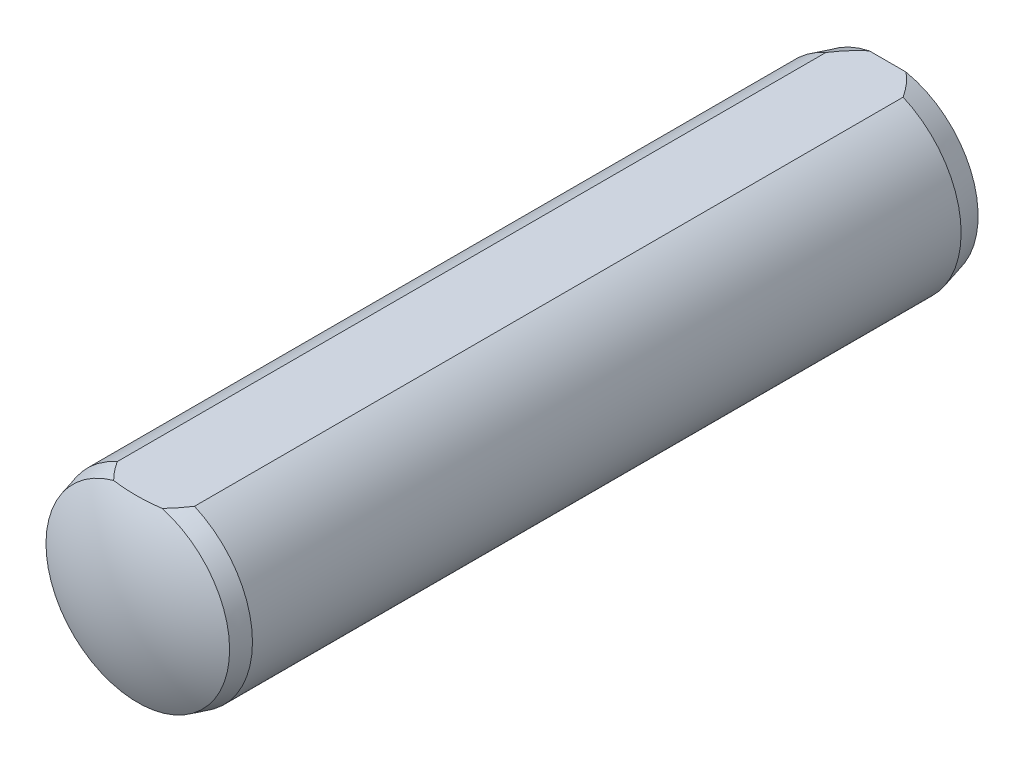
ISO-10303-21;
HEADER;
FILE_DESCRIPTION(('STEP AP214'),'2;1');
FILE_NAME('part.step','',(''),(''),'','','');
FILE_SCHEMA(('AUTOMOTIVE_DESIGN { 1 0 10303 214 1 1 1 1 }'));
ENDSEC;
DATA;
#1=APPLICATION_CONTEXT('core data for automotive mechanical design processes');
#2=APPLICATION_PROTOCOL_DEFINITION('international standard','automotive_design',2000,#1);
#3=PRODUCT_CONTEXT('',#1,'mechanical');
#4=PRODUCT('Part','Part','',(#3));
#5=PRODUCT_RELATED_PRODUCT_CATEGORY('part','',(#4));
#6=PRODUCT_DEFINITION_FORMATION('','',#4);
#7=PRODUCT_DEFINITION_CONTEXT('part definition',#1,'design');
#8=PRODUCT_DEFINITION('design','',#6,#7);
#9=PRODUCT_DEFINITION_SHAPE('','',#8);
#10=(LENGTH_UNIT() NAMED_UNIT(*) SI_UNIT(.MILLI.,.METRE.));
#11=(NAMED_UNIT(*) PLANE_ANGLE_UNIT() SI_UNIT($,.RADIAN.));
#12=(NAMED_UNIT(*) SI_UNIT($,.STERADIAN.) SOLID_ANGLE_UNIT());
#13=UNCERTAINTY_MEASURE_WITH_UNIT(LENGTH_MEASURE(1.E-05),#10,'distance_accuracy_value','');
#14=(GEOMETRIC_REPRESENTATION_CONTEXT(3) GLOBAL_UNCERTAINTY_ASSIGNED_CONTEXT((#13)) GLOBAL_UNIT_ASSIGNED_CONTEXT((#10,
#11,#12)) REPRESENTATION_CONTEXT('',''));
#15=CARTESIAN_POINT('',(0.,0.,0.));
#16=DIRECTION('',(0.,0.,1.));
#17=DIRECTION('',(1.,0.,0.));
#18=AXIS2_PLACEMENT_3D('',#15,#16,#17);
#19=CARTESIAN_POINT('',(0.,0.,15.));
#20=DIRECTION('',(0.,0.,1.));
#21=DIRECTION('',(0.,1.,0.));
#22=AXIS2_PLACEMENT_3D('',#19,#20,#21);
#23=SPHERICAL_SURFACE('',#22,5.);
#24=CARTESIAN_POINT('',(0.,0.,19.4));
#25=DIRECTION('',(0.,0.,1.));
#26=DIRECTION('',(1.,0.,0.));
#27=AXIS2_PLACEMENT_3D('',#24,#25,#26);
#28=CIRCLE('',#27,2.37486841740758);
#29=CARTESIAN_POINT('',(-0.624499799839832,2.29128784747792,19.4));
#30=VERTEX_POINT('',#29);
#31=CARTESIAN_POINT('',(0.624499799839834,2.29128784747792,19.4));
#32=VERTEX_POINT('',#31);
#33=EDGE_CURVE('E126',#30,#32,#28,.T.);
#34=ORIENTED_EDGE('',*,*,#33,.T.);
#35=CARTESIAN_POINT('',(0.,2.29128784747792,15.));
#36=DIRECTION('',(0.,-1.,0.));
#37=DIRECTION('',(0.,0.,-1.));
#38=AXIS2_PLACEMENT_3D('',#35,#36,#37);
#39=CIRCLE('',#38,4.4440972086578);
#40=EDGE_CURVE('E87',#32,#30,#39,.T.);
#41=ORIENTED_EDGE('',*,*,#40,.T.);
#42=EDGE_LOOP('',(#34,#41));
#43=FACE_BOUND('',#42,.T.);
#44=ADVANCED_FACE('F32',(#43),#23,.T.);
#45=CARTESIAN_POINT('',(0.,0.,6.4));
#46=DIRECTION('',(0.,0.,-1.));
#47=DIRECTION('',(-1.,0.,0.));
#48=AXIS2_PLACEMENT_3D('',#45,#46,#47);
#49=CONICAL_SURFACE('',#48,0.,1.04719755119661);
#50=CARTESIAN_POINT('',(0.,0.,5.67831216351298));
#51=DIRECTION('',(0.,0.,1.));
#52=DIRECTION('',(1.,0.,0.));
#53=AXIS2_PLACEMENT_3D('',#50,#51,#52);
#54=CIRCLE('',#53,1.25);
#55=CARTESIAN_POINT('',(1.25,0.,5.67831216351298));
#56=VERTEX_POINT('',#55);
#57=EDGE_CURVE('E116',#56,#56,#54,.T.);
#58=ORIENTED_EDGE('',*,*,#57,.F.);
#59=EDGE_LOOP('',(#58));
#60=FACE_BOUND('',#59,.T.);
#61=CARTESIAN_POINT('',(0.,0.,6.4));
#62=VERTEX_POINT('',#61);
#63=VERTEX_LOOP('',#62);
#64=FACE_BOUND('',#63,.T.);
#65=ADVANCED_FACE('F150',(#60,#64),#49,.F.);
#66=CARTESIAN_POINT('',(0.,0.,6.4));
#67=DIRECTION('',(0.,0.,1.));
#68=DIRECTION('',(1.,0.,0.));
#69=AXIS2_PLACEMENT_3D('',#66,#67,#68);
#70=CYLINDRICAL_SURFACE('',#69,1.25);
#71=CARTESIAN_POINT('',(0.,0.,6.));
#72=DIRECTION('',(0.,0.,1.));
#73=DIRECTION('',(1.,0.,0.));
#74=AXIS2_PLACEMENT_3D('',#71,#72,#73);
#75=CIRCLE('',#74,1.25);
#76=CARTESIAN_POINT('',(1.25,0.,6.));
#77=VERTEX_POINT('',#76);
#78=EDGE_CURVE('E114',#77,#77,#75,.T.);
#79=ORIENTED_EDGE('',*,*,#78,.F.);
#80=EDGE_LOOP('',(#79));
#81=FACE_BOUND('',#80,.T.);
#82=ORIENTED_EDGE('',*,*,#57,.T.);
#83=EDGE_LOOP('',(#82));
#84=FACE_BOUND('',#83,.T.);
#85=ADVANCED_FACE('F155',(#81,#84),#70,.T.);
#86=CARTESIAN_POINT('',(0.,1.5,6.));
#87=DIRECTION('',(0.,0.,1.));
#88=DIRECTION('',(1.,0.,0.));
#89=AXIS2_PLACEMENT_3D('',#86,#87,#88);
#90=PLANE('',#89);
#91=CARTESIAN_POINT('',(0.,0.,6.));
#92=DIRECTION('',(0.,0.,1.));
#93=DIRECTION('',(1.,0.,0.));
#94=AXIS2_PLACEMENT_3D('',#91,#92,#93);
#95=CIRCLE('',#94,1.5);
#96=CARTESIAN_POINT('',(1.5,0.,6.));
#97=VERTEX_POINT('',#96);
#98=EDGE_CURVE('E111',#97,#97,#95,.T.);
#99=ORIENTED_EDGE('',*,*,#98,.F.);
#100=EDGE_LOOP('',(#99));
#101=FACE_BOUND('',#100,.T.);
#102=ORIENTED_EDGE('',*,*,#78,.T.);
#103=EDGE_LOOP('',(#102));
#104=FACE_BOUND('',#103,.T.);
#105=ADVANCED_FACE('F161',(#101,#104),#90,.F.);
#106=CARTESIAN_POINT('',(0.,0.,6.4));
#107=DIRECTION('',(0.,0.,1.));
#108=DIRECTION('',(1.,0.,0.));
#109=AXIS2_PLACEMENT_3D('',#106,#107,#108);
#110=CYLINDRICAL_SURFACE('',#109,1.5);
#111=CARTESIAN_POINT('',(0.,0.,1.08660254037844));
#112=DIRECTION('',(0.,0.,1.));
#113=DIRECTION('',(1.,0.,0.));
#114=AXIS2_PLACEMENT_3D('',#111,#112,#113);
#115=CIRCLE('',#114,1.5);
#116=CARTESIAN_POINT('',(1.5,0.,1.08660254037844));
#117=VERTEX_POINT('',#116);
#118=EDGE_CURVE('E108',#117,#117,#115,.T.);
#119=ORIENTED_EDGE('',*,*,#118,.F.);
#120=EDGE_LOOP('',(#119));
#121=FACE_BOUND('',#120,.T.);
#122=ORIENTED_EDGE('',*,*,#98,.T.);
#123=EDGE_LOOP('',(#122));
#124=FACE_BOUND('',#123,.T.);
#125=ADVANCED_FACE('F167',(#121,#124),#110,.F.);
#126=CARTESIAN_POINT('',(0.,0.,1.08660254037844));
#127=DIRECTION('',(0.,0.,-1.));
#128=DIRECTION('',(-1.,0.,0.));
#129=AXIS2_PLACEMENT_3D('',#126,#127,#128);
#130=CONICAL_SURFACE('',#129,1.5,1.04719755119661);
#131=CARTESIAN_POINT('',(0.,0.,1.));
#132=DIRECTION('',(0.,0.,1.));
#133=DIRECTION('',(1.,0.,0.));
#134=AXIS2_PLACEMENT_3D('',#131,#132,#133);
#135=CIRCLE('',#134,1.65);
#136=CARTESIAN_POINT('',(1.65,0.,1.));
#137=VERTEX_POINT('',#136);
#138=EDGE_CURVE('E100',#137,#137,#135,.T.);
#139=ORIENTED_EDGE('',*,*,#138,.F.);
#140=EDGE_LOOP('',(#139));
#141=FACE_BOUND('',#140,.T.);
#142=ORIENTED_EDGE('',*,*,#118,.T.);
#143=EDGE_LOOP('',(#142));
#144=FACE_BOUND('',#143,.T.);
#145=ADVANCED_FACE('F171',(#141,#144),#130,.F.);
#146=CARTESIAN_POINT('',(0.,0.,6.4));
#147=DIRECTION('',(0.,0.,1.));
#148=DIRECTION('',(1.,0.,0.));
#149=AXIS2_PLACEMENT_3D('',#146,#147,#148);
#150=CYLINDRICAL_SURFACE('',#149,1.65);
#151=CARTESIAN_POINT('',(0.,0.,0.));
#152=DIRECTION('',(0.,0.,1.));
#153=DIRECTION('',(1.,0.,0.));
#154=AXIS2_PLACEMENT_3D('',#151,#152,#153);
#155=CIRCLE('',#154,1.65);
#156=CARTESIAN_POINT('',(1.65,0.,0.));
#157=VERTEX_POINT('',#156);
#158=EDGE_CURVE('E96',#157,#157,#155,.T.);
#159=ORIENTED_EDGE('',*,*,#158,.F.);
#160=EDGE_LOOP('',(#159));
#161=FACE_BOUND('',#160,.T.);
#162=ORIENTED_EDGE('',*,*,#138,.T.);
#163=EDGE_LOOP('',(#162));
#164=FACE_BOUND('',#163,.T.);
#165=ADVANCED_FACE('F175',(#161,#164),#150,.F.);
#166=CARTESIAN_POINT('',(0.,2.33923048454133,0.));
#167=DIRECTION('',(0.,0.,1.));
#168=DIRECTION('',(1.,0.,0.));
#169=AXIS2_PLACEMENT_3D('',#166,#167,#168);
#170=PLANE('',#169);
#171=CARTESIAN_POINT('',(0.,0.,0.));
#172=DIRECTION('',(0.,0.,1.));
#173=DIRECTION('',(1.,0.,0.));
#174=AXIS2_PLACEMENT_3D('',#171,#172,#173);
#175=CIRCLE('',#174,2.33923048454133);
#176=CARTESIAN_POINT('',(-0.471167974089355,2.29128784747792,0.));
#177=VERTEX_POINT('',#176);
#178=CARTESIAN_POINT('',(0.471167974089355,2.29128784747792,0.));
#179=VERTEX_POINT('',#178);
#180=EDGE_CURVE('E93',#177,#179,#175,.T.);
#181=ORIENTED_EDGE('',*,*,#180,.F.);
#182=DIRECTION('',(-1.,0.,0.));
#183=VECTOR('',#182,1.);
#184=CARTESIAN_POINT('',(1.,2.29128784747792,0.));
#185=LINE('',#184,#183);
#186=EDGE_CURVE('E78',#179,#177,#185,.T.);
#187=ORIENTED_EDGE('',*,*,#186,.F.);
#188=EDGE_LOOP('',(#181,#187));
#189=FACE_BOUND('',#188,.T.);
#190=ORIENTED_EDGE('',*,*,#158,.T.);
#191=EDGE_LOOP('',(#190));
#192=FACE_BOUND('',#191,.T.);
#193=ADVANCED_FACE('F91',(#189,#192),#170,.F.);
#194=CARTESIAN_POINT('',(0.,0.,0.));
#195=DIRECTION('',(0.,0.,1.));
#196=DIRECTION('',(1.,0.,0.));
#197=AXIS2_PLACEMENT_3D('',#194,#195,#196);
#198=CONICAL_SURFACE('',#197,2.33923048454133,0.261799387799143);
#199=CARTESIAN_POINT('',(0.,0.,0.6));
#200=DIRECTION('',(0.,0.,1.));
#201=DIRECTION('',(1.,0.,0.));
#202=AXIS2_PLACEMENT_3D('',#199,#200,#201);
#203=CIRCLE('',#202,2.5);
#204=CARTESIAN_POINT('',(-1.,2.29128784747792,0.6));
#205=VERTEX_POINT('',#204);
#206=CARTESIAN_POINT('',(1.,2.29128784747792,0.6));
#207=VERTEX_POINT('',#206);
#208=EDGE_CURVE('E97',#205,#207,#203,.T.);
#209=ORIENTED_EDGE('',*,*,#208,.F.);
#210=CARTESIAN_POINT('',(-1.67077202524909,2.29128784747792,1.85303678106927));
#211=CARTESIAN_POINT('',(-1.62356949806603,2.29128784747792,1.74936709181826));
#212=CARTESIAN_POINT('',(-1.57536560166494,2.29128784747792,1.64613079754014));
#213=CARTESIAN_POINT('',(-1.47612152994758,2.29128784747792,1.44077448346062));
#214=CARTESIAN_POINT('',(-1.42507575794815,2.29128784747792,1.33865717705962));
#215=CARTESIAN_POINT('',(-1.31778480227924,2.29128784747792,1.13292437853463));
#216=CARTESIAN_POINT('',(-1.26142451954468,2.29128784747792,1.02936815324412));
#217=CARTESIAN_POINT('',(-1.14372956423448,2.29128784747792,0.82523392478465));
#218=CARTESIAN_POINT('',(-1.08239962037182,2.29128784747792,0.72465321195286));
#219=CARTESIAN_POINT('',(-0.953096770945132,2.29128784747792,0.528730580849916));
#220=CARTESIAN_POINT('',(-0.88517531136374,2.29128784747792,0.433355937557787));
#221=CARTESIAN_POINT('',(-0.775669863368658,2.29128784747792,0.296895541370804));
#222=CARTESIAN_POINT('',(-0.738043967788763,2.29128784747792,0.252654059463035));
#223=CARTESIAN_POINT('',(-0.659543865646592,2.29128784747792,0.167180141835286));
#224=CARTESIAN_POINT('',(-0.618673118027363,2.29128784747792,0.125944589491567));
#225=CARTESIAN_POINT('',(-0.540762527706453,2.29128784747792,0.0550878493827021));
#226=CARTESIAN_POINT('',(-0.504404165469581,2.29128784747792,0.0247265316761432));
#227=CARTESIAN_POINT('',(-0.428435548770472,2.29128784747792,-0.0318304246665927));
#228=CARTESIAN_POINT('',(-0.388820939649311,2.29128784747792,-0.0580203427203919));
#229=CARTESIAN_POINT('',(-0.305439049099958,2.29128784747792,-0.104672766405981));
#230=CARTESIAN_POINT('',(-0.261617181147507,2.29128784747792,-0.125040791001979));
#231=CARTESIAN_POINT('',(-0.170863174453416,2.29128784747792,-0.156814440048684));
#232=CARTESIAN_POINT('',(-0.123944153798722,2.29128784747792,-0.168255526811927));
#233=CARTESIAN_POINT('',(-0.0409742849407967,2.29128784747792,-0.178580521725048));
#234=CARTESIAN_POINT('',(-0.00522769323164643,2.29128784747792,-0.179935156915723));
#235=CARTESIAN_POINT('',(0.0659711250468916,2.29128784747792,-0.176411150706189));
#236=CARTESIAN_POINT('',(0.101423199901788,2.29128784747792,-0.17152947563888));
#237=CARTESIAN_POINT('',(0.170829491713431,2.29128784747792,-0.156163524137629));
#238=CARTESIAN_POINT('',(0.20479139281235,2.29128784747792,-0.145712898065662));
#239=CARTESIAN_POINT('',(0.270918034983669,2.29128784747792,-0.120233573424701));
#240=CARTESIAN_POINT('',(0.303082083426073,2.29128784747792,-0.105203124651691));
#241=CARTESIAN_POINT('',(0.392489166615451,2.29128784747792,-0.0570483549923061));
#242=CARTESIAN_POINT('',(0.447339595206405,2.29128784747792,-0.0195241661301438));
#243=CARTESIAN_POINT('',(0.551185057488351,2.29128784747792,0.0629669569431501));
#244=CARTESIAN_POINT('',(0.600151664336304,2.29128784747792,0.10796770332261));
#245=CARTESIAN_POINT('',(0.717749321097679,2.29128784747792,0.227164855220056));
#246=CARTESIAN_POINT('',(0.783312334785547,2.29128784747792,0.304344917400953));
#247=CARTESIAN_POINT('',(0.907188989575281,2.29128784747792,0.46439487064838));
#248=CARTESIAN_POINT('',(0.965483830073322,2.29128784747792,0.547278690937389));
#249=CARTESIAN_POINT('',(1.07710907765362,2.29128784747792,0.716871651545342));
#250=CARTESIAN_POINT('',(1.13041407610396,2.29128784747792,0.803597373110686));
#251=CARTESIAN_POINT('',(1.23313212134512,2.29128784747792,0.97933166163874));
#252=CARTESIAN_POINT('',(1.28254386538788,2.29128784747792,1.06834097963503));
#253=CARTESIAN_POINT('',(1.39157850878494,2.29128784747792,1.27266836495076));
#254=CARTESIAN_POINT('',(1.45026745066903,2.29128784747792,1.38848298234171));
#255=CARTESIAN_POINT('',(1.53523801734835,2.29128784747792,1.56276631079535));
#256=CARTESIAN_POINT('',(1.56288279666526,2.29128784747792,1.6205805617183));
#257=CARTESIAN_POINT('',(1.61738792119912,2.29128784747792,1.73655746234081));
#258=CARTESIAN_POINT('',(1.64424849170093,2.29128784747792,1.79472000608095));
#259=CARTESIAN_POINT('',(1.67077202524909,2.29128784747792,1.85303678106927));
#260=B_SPLINE_CURVE_WITH_KNOTS('',3,(#210,#211,#212,#213,#214,#215,#216,#217,#218,#219,#220,
#221,#222,#223,#224,#225,#226,#227,#228,#229,#230,#231,#232,#233,#234,#235,#236,#237,#238,#239,
#240,#241,#242,#243,#244,#245,#246,#247,#248,#249,#250,#251,#252,#253,#254,#255,#256,#257,#258,
#259),.UNSPECIFIED.,.F.,.F.,(4,2,2,2,2,2,2,2,2,2,2,2,2,2,2,2,2,2,2,2,2,2,2,2,4),(0.,
0.341754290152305,0.684207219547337,1.03779629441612,1.3910527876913,1.74174531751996,
1.91586342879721,2.08979836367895,2.23168823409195,2.37377104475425,2.51804340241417,
2.66173967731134,2.76852312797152,2.87535854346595,2.98155560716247,3.08779330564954,
3.28599602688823,3.48512080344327,3.78812701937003,4.09190144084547,4.39714696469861,
4.70249419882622,5.09190654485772,5.28415416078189,5.4763459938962),.UNSPECIFIED.);
#261=EDGE_CURVE('E86',#205,#177,#260,.T.);
#262=ORIENTED_EDGE('',*,*,#261,.T.);
#263=ORIENTED_EDGE('',*,*,#180,.T.);
#264=EDGE_CURVE('E75',#179,#207,#260,.T.);
#265=ORIENTED_EDGE('',*,*,#264,.T.);
#266=EDGE_LOOP('',(#209,#262,#263,#265));
#267=FACE_BOUND('',#266,.T.);
#268=ADVANCED_FACE('F95',(#267),#198,.T.);
#269=CARTESIAN_POINT('',(0.,0.,6.4));
#270=DIRECTION('',(0.,0.,1.));
#271=DIRECTION('',(1.,0.,0.));
#272=AXIS2_PLACEMENT_3D('',#269,#270,#271);
#273=CYLINDRICAL_SURFACE('',#272,2.5);
#274=ORIENTED_EDGE('',*,*,#208,.T.);
#275=DIRECTION('',(0.,0.,-1.));
#276=VECTOR('',#275,1.);
#277=CARTESIAN_POINT('',(1.,2.29128784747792,20.));
#278=LINE('',#277,#276);
#279=CARTESIAN_POINT('',(1.,2.29128784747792,18.9330025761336));
#280=VERTEX_POINT('',#279);
#281=EDGE_CURVE('E81',#280,#207,#278,.T.);
#282=ORIENTED_EDGE('',*,*,#281,.F.);
#283=CARTESIAN_POINT('',(0.,0.,18.9330025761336));
#284=DIRECTION('',(0.,0.,1.));
#285=DIRECTION('',(1.,0.,0.));
#286=AXIS2_PLACEMENT_3D('',#283,#284,#285);
#287=CIRCLE('',#286,2.5);
#288=CARTESIAN_POINT('',(-0.999999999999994,2.29128784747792,18.9330025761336));
#289=VERTEX_POINT('',#288);
#290=EDGE_CURVE('E102',#289,#280,#287,.T.);
#291=ORIENTED_EDGE('',*,*,#290,.F.);
#292=DIRECTION('',(0.,0.,-1.));
#293=VECTOR('',#292,1.);
#294=CARTESIAN_POINT('',(-1.,2.29128784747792,20.));
#295=LINE('',#294,#293);
#296=EDGE_CURVE('E51',#289,#205,#295,.T.);
#297=ORIENTED_EDGE('',*,*,#296,.T.);
#298=EDGE_LOOP('',(#274,#282,#291,#297));
#299=FACE_BOUND('',#298,.T.);
#300=ADVANCED_FACE('F129',(#299),#273,.T.);
#301=CARTESIAN_POINT('',(0.,0.,18.9330025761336));
#302=DIRECTION('',(0.,0.,-1.));
#303=DIRECTION('',(-1.,0.,0.));
#304=AXIS2_PLACEMENT_3D('',#301,#302,#303);
#305=CONICAL_SURFACE('',#304,2.5,0.26179938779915);
#306=ORIENTED_EDGE('',*,*,#290,.T.);
#307=CARTESIAN_POINT('',(1.66140547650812,2.29128784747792,17.7005237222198));
#308=CARTESIAN_POINT('',(1.61455555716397,2.29128784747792,17.8030373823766));
#309=CARTESIAN_POINT('',(1.56671109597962,2.29128784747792,17.9051238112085));
#310=CARTESIAN_POINT('',(1.46821930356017,2.29128784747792,18.1081591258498));
#311=CARTESIAN_POINT('',(1.41756706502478,2.29128784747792,18.2091056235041));
#312=CARTESIAN_POINT('',(1.31317944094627,2.29128784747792,18.4084984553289));
#313=CARTESIAN_POINT('',(1.25946832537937,2.29128784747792,18.5069574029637));
#314=CARTESIAN_POINT('',(1.14754312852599,2.29128784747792,18.701223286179));
#315=CARTESIAN_POINT('',(1.08933263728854,2.29128784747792,18.7970322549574));
#316=CARTESIAN_POINT('',(0.986612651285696,2.29128784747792,18.9539310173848));
#317=CARTESIAN_POINT('',(0.943832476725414,2.29128784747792,19.0161462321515));
#318=CARTESIAN_POINT('',(0.854270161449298,2.29128784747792,19.1382715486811));
#319=CARTESIAN_POINT('',(0.807464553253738,2.29128784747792,19.198164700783));
#320=CARTESIAN_POINT('',(0.726816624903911,2.29128784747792,19.292702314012));
#321=CARTESIAN_POINT('',(0.694463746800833,2.29128784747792,19.3285960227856));
#322=CARTESIAN_POINT('',(0.6273359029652,2.29128784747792,19.3980286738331));
#323=CARTESIAN_POINT('',(0.592558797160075,2.29128784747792,19.431565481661));
#324=CARTESIAN_POINT('',(0.484362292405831,2.29128784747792,19.5268679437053));
#325=CARTESIAN_POINT('',(0.406407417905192,2.29128784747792,19.5841729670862));
#326=CARTESIAN_POINT('',(0.287435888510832,2.29128784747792,19.6458058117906));
#327=CARTESIAN_POINT('',(0.252275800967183,2.29128784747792,19.6613024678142));
#328=CARTESIAN_POINT('',(0.179958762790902,2.29128784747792,19.6866439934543));
#329=CARTESIAN_POINT('',(0.142804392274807,2.29128784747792,19.6964959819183));
#330=CARTESIAN_POINT('',(0.0669679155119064,2.29128784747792,19.7094486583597));
#331=CARTESIAN_POINT('',(0.0282754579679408,2.29128784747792,19.7124908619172));
#332=CARTESIAN_POINT('',(-0.0489988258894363,2.29128784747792,19.7111881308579));
#333=CARTESIAN_POINT('',(-0.0875805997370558,2.29128784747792,19.7068401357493));
#334=CARTESIAN_POINT('',(-0.159750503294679,2.29128784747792,19.6921269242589));
#335=CARTESIAN_POINT('',(-0.193467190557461,2.29128784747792,19.6823655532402));
#336=CARTESIAN_POINT('',(-0.259183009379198,2.29128784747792,19.6582587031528));
#337=CARTESIAN_POINT('',(-0.291181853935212,2.29128784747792,19.6439124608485));
#338=CARTESIAN_POINT('',(-0.379130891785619,2.29128784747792,19.598214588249));
#339=CARTESIAN_POINT('',(-0.432867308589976,2.29128784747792,19.562643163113));
#340=CARTESIAN_POINT('',(-0.534719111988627,2.29128784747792,19.4841372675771));
#341=CARTESIAN_POINT('',(-0.58280768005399,2.29128784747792,19.4411698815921));
#342=CARTESIAN_POINT('',(-0.696788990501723,2.29128784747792,19.3286478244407));
#343=CARTESIAN_POINT('',(-0.759929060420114,2.29128784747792,19.2563452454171));
#344=CARTESIAN_POINT('',(-0.879344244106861,2.29128784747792,19.1062035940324));
#345=CARTESIAN_POINT('',(-0.935601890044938,2.29128784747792,19.0283511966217));
#346=CARTESIAN_POINT('',(-1.04339728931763,2.29128784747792,18.8688659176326));
#347=CARTESIAN_POINT('',(-1.09490813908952,2.29128784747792,18.7872150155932));
#348=CARTESIAN_POINT('',(-1.19417483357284,2.29128784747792,18.6216523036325));
#349=CARTESIAN_POINT('',(-1.24192933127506,2.29128784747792,18.5377396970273));
#350=CARTESIAN_POINT('',(-1.35592554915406,2.29128784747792,18.3292555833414));
#351=CARTESIAN_POINT('',(-1.42052889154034,2.29128784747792,18.2037909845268));
#352=CARTESIAN_POINT('',(-1.51365705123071,2.29128784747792,18.0149267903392));
#353=CARTESIAN_POINT('',(-1.54385592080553,2.29128784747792,17.9523363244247));
#354=CARTESIAN_POINT('',(-1.60330520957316,2.29128784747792,17.8267333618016));
#355=CARTESIAN_POINT('',(-1.63255596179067,2.29128784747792,17.7637210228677));
#356=CARTESIAN_POINT('',(-1.66140547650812,2.29128784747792,17.7005237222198));
#357=B_SPLINE_CURVE_WITH_KNOTS('',3,(#307,#308,#309,#310,#311,#312,#313,#314,#315,#316,#317,
#318,#319,#320,#321,#322,#323,#324,#325,#326,#327,#328,#329,#330,#331,#332,#333,#334,#335,#336,
#337,#338,#339,#340,#341,#342,#343,#344,#345,#346,#347,#348,#349,#350,#351,#352,#353,#354,#355,
#356),.UNSPECIFIED.,.F.,.F.,(4,2,2,2,2,2,2,2,2,2,2,2,2,2,2,2,2,2,2,2,2,2,2,2,4),(0.,
0.338168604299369,0.67694811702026,1.01333778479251,1.34946176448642,1.57587824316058,
1.80371807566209,1.94855385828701,2.09351915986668,2.38022569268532,2.49513269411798,
2.60989445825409,2.72563810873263,2.84142970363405,2.94634014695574,3.05126806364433,
3.24346351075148,3.43653754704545,3.72375946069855,4.01169586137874,4.30117498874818,
4.59075745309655,5.01397510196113,5.22245565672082,5.43086217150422),.UNSPECIFIED.);
#358=EDGE_CURVE('E11',#280,#32,#357,.T.);
#359=ORIENTED_EDGE('',*,*,#358,.T.);
#360=ORIENTED_EDGE('',*,*,#33,.F.);
#361=EDGE_CURVE('E35',#30,#289,#357,.T.);
#362=ORIENTED_EDGE('',*,*,#361,.T.);
#363=EDGE_LOOP('',(#306,#359,#360,#362));
#364=FACE_BOUND('',#363,.T.);
#365=ADVANCED_FACE('F124',(#364),#305,.T.);
#366=CARTESIAN_POINT('',(1.,2.29128784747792,20.));
#367=DIRECTION('',(0.,-1.,0.));
#368=DIRECTION('',(0.,0.,-1.));
#369=AXIS2_PLACEMENT_3D('',#366,#367,#368);
#370=PLANE('',#369);
#371=ORIENTED_EDGE('',*,*,#296,.F.);
#372=ORIENTED_EDGE('',*,*,#361,.F.);
#373=ORIENTED_EDGE('',*,*,#40,.F.);
#374=ORIENTED_EDGE('',*,*,#358,.F.);
#375=ORIENTED_EDGE('',*,*,#281,.T.);
#376=ORIENTED_EDGE('',*,*,#264,.F.);
#377=ORIENTED_EDGE('',*,*,#186,.T.);
#378=ORIENTED_EDGE('',*,*,#261,.F.);
#379=EDGE_LOOP('',(#371,#372,#373,#374,#375,#376,#377,#378));
#380=FACE_BOUND('',#379,.T.);
#381=ADVANCED_FACE('F77',(#380),#370,.F.);
#382=CLOSED_SHELL('',(#44,#65,#85,#105,#125,#145,#165,#193,#268,#300,#365,#381));
#383=MANIFOLD_SOLID_BREP('B2',#382);
#384=ADVANCED_BREP_SHAPE_REPRESENTATION('',(#18,#383),#14);
#385=SHAPE_DEFINITION_REPRESENTATION(#9,#384);
ENDSEC;
END-ISO-10303-21;
